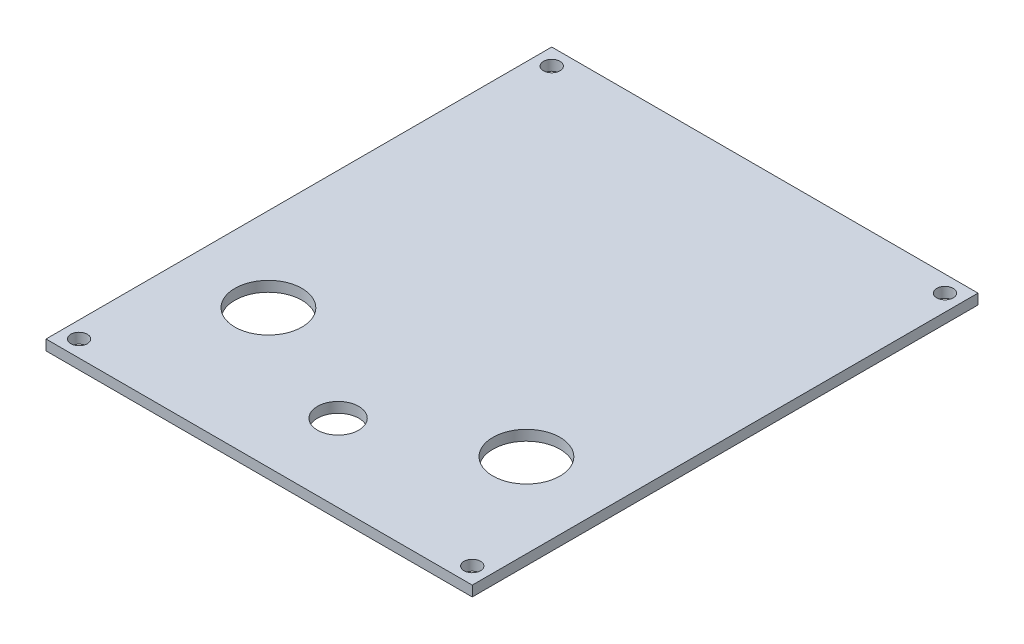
from build123d import *

# Parameters (mm, degrees)
SKETCH1_W                  = 82.6
SKETCH1_H                  = 98
BOSS_EXTRUDE1_DEPTH        = 2
F_3_2_3_2_DIAMETER_HOLE1_D = 3.2
SKETCH4_R                  = 6.5
CUT_EXTRUDE1_DEPTH         = 2
SKETCH6_R                  = 4
CUT_EXTRUDE2_DEPTH         = 10


with BuildPart() as part:
    # Sketch1 → Boss-Extrude1 (new body)
    with BuildSketch(Plane(origin=(0, 0, 0), x_dir=(1, 0, 0), z_dir=(0, 1, 0))):
        Rectangle(SKETCH1_W, SKETCH1_H)
    extrude(amount=BOSS_EXTRUDE1_DEPTH)

    # 3.2 _3.2_ Diameter Hole1 (through all)
    with Locations(Plane(origin=(0, 2, 0), x_dir=(1, 0, 0), z_dir=(0, 1, 0))):
        with Locations((-38.1, 45.8), (38.1, 45.8), (38.1, -45.8), (-38.1, -45.8)):
            Hole(F_3_2_3_2_DIAMETER_HOLE1_D / 2)

    # Sketch4 → Cut-Extrude1 (cut)
    with BuildSketch(Plane(origin=(0, 2, 0), x_dir=(1, 0, 0), z_dir=(0, 1, 0))):
        with Locations(Location((-25, -22.2, 0), (0, 0, 270))):
            Circle(SKETCH4_R)
        with Locations(Location((25, -22.2, 0), (0, 0, 270))):
            Circle(SKETCH4_R)
    extrude(amount=-CUT_EXTRUDE1_DEPTH, mode=Mode.SUBTRACT)

    # Sketch6 → Cut-Extrude2 (cut)
    with BuildSketch(Plane(origin=(0, 2, 0), x_dir=(1, 0, 0), z_dir=(0, 1, 0))):
        with Locations(Location((0.3, -34, 0), (0, 0, 270))):
            Circle(SKETCH6_R)
    extrude(amount=-CUT_EXTRUDE2_DEPTH, mode=Mode.SUBTRACT)


solid = part.part
